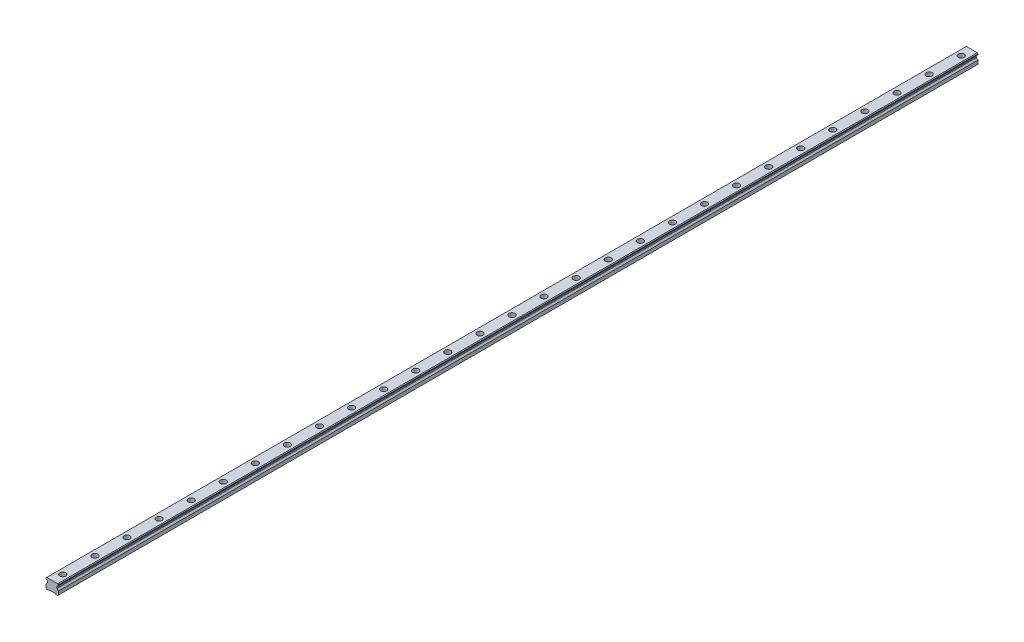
from build123d import *

# Parameters (mm, degrees)
SKETCH1_W           = 23
SKETCH1_H           = 19.2
BOSS_EXTRUDE1_DEPTH = 860
CUT_EXTRUDE1_DEPTH  = 1721.145601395
CHAMFER1_SIZE       = 1.25
FILLET1_R           = 1.25
CUT_EXTRUDE2_DEPTH  = 1721.145601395
SKETCH4_R           = 5.5
SKETCH4_R_2         = 3.5
CUT_EXTRUDE3_DEPTH  = 9
SKETCH4_2_R         = 3.5
CUT_EXTRUDE4_DEPTH  = 861.291165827
LPATTERN1_COUNT     = 29
LPATTERN1_PITCH     = 60


with BuildPart() as part:
    # Sketch1 → Boss-Extrude1 (new, symmetric)
    with BuildSketch(Plane.XY):
        with Locations((0, 9.6)):
            Rectangle(SKETCH1_W, SKETCH1_H)
    extrude(amount=BOSS_EXTRUDE1_DEPTH, both=True)

    # Sketch2 → Cut-Extrude1 (cut, through all)
    with BuildSketch(Plane.XY.offset(860)):
        Polygon((-11.5, 16.7), (-11.5, 7.95), (-8.583333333, 10.866666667), (-8.583333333, 13.783333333), align=None)
        Polygon((8.583333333, 13.783333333), (11.5, 16.7), (11.5, 7.95), (8.583333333, 10.866666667), align=None)
    extrude(amount=-CUT_EXTRUDE1_DEPTH, mode=Mode.SUBTRACT)

    # Chamfer1
    chamfer1_edges = [part.edges().sort_by_distance(p)[0] for p in [
        (-11.5, 19.2, 0),
        (11.5, 19.2, 0),
        (11.5, 0, 0),
        (-11.5, 0, 0),
    ]]
    chamfer(chamfer1_edges, length=CHAMFER1_SIZE)

    # Fillet1
    fillet1_edges = [part.edges().sort_by_distance(p)[0] for p in [
        (-8.583333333, 13.783333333, 0),
        (-8.583333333, 10.866666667, 0),
        (8.583333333, 10.866666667, 0),
        (8.583333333, 13.783333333, 0),
    ]]
    fillet(fillet1_edges, radius=FILLET1_R)

    # Sketch3 → Cut-Extrude2 (cut, through all)
    with BuildSketch(Plane.XY.offset(860)):
        Polygon((-7, 0), (-5.75, 1.25), (5.75, 1.25), (7, 0), align=None)
    extrude(amount=-CUT_EXTRUDE2_DEPTH, mode=Mode.SUBTRACT)

    # Sketch4 → Cut-Extrude3 (cut)
    with BuildSketch(Plane(origin=(0, 19.2, 0), x_dir=(1, 0, 0), z_dir=(0, 1, 0))):
        with Locations(Location((0, -840, 0), (0, 0, 270))):
            Circle(SKETCH4_R)
        with Locations(Location((0, -840, 0), (0, 0, 270))):
            Circle(SKETCH4_R_2, mode=Mode.SUBTRACT)
    cut_extrude3 = extrude(amount=-CUT_EXTRUDE3_DEPTH, mode=Mode.SUBTRACT)

    # Sketch4_2 → Cut-Extrude4 (cut, through all)
    with BuildSketch(Plane(origin=(0, 19.2, 0), x_dir=(1, 0, 0), z_dir=(0, 1, 0))):
        with Locations(Location((0, -840, 0), (0, 0, 270))):
            Circle(SKETCH4_2_R)
    cut_extrude4 = extrude(amount=-CUT_EXTRUDE4_DEPTH, mode=Mode.SUBTRACT)

    # LPattern1: Cut-Extrude3, Cut-Extrude4 ×29
    with Locations(*[(0, 0, -i * LPATTERN1_PITCH) for i in range(1, LPATTERN1_COUNT)]):
        add(cut_extrude3, mode=Mode.SUBTRACT)
        add(cut_extrude4, mode=Mode.SUBTRACT)


solid = part.part
